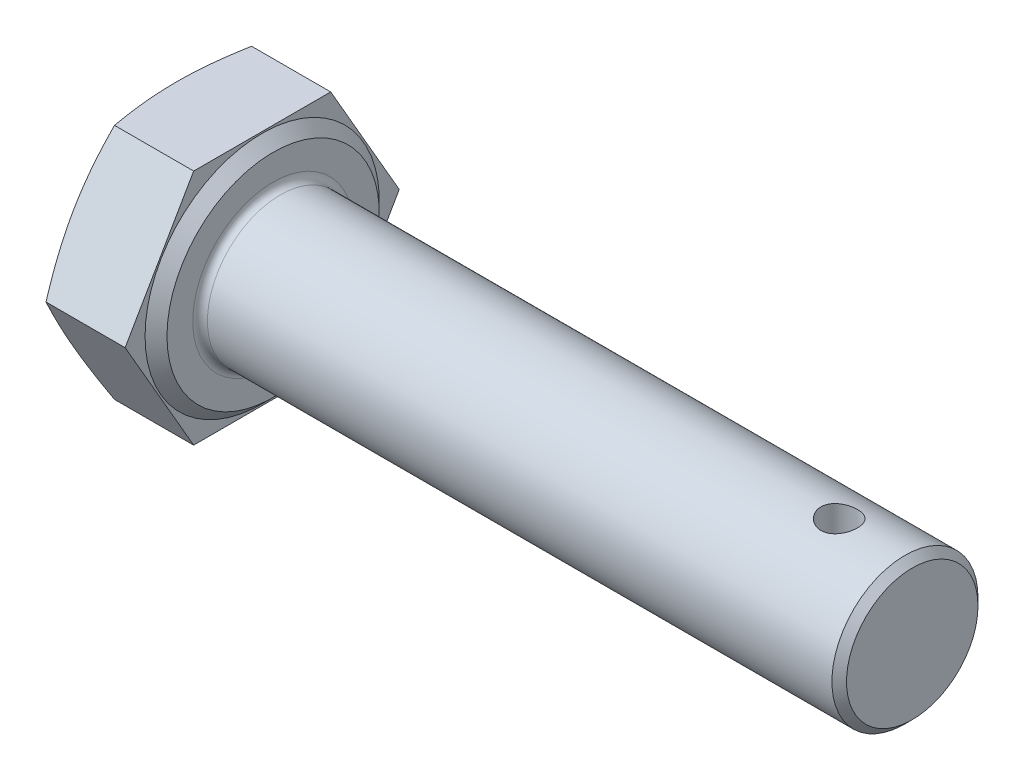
ISO-10303-21;
HEADER;
FILE_DESCRIPTION(('STEP AP214'),'2;1');
FILE_NAME('part.step','',(''),(''),'','','');
FILE_SCHEMA(('AUTOMOTIVE_DESIGN { 1 0 10303 214 1 1 1 1 }'));
ENDSEC;
DATA;
#1=APPLICATION_CONTEXT('core data for automotive mechanical design processes');
#2=APPLICATION_PROTOCOL_DEFINITION('international standard','automotive_design',2000,#1);
#3=PRODUCT_CONTEXT('',#1,'mechanical');
#4=PRODUCT('Part','Part','',(#3));
#5=PRODUCT_RELATED_PRODUCT_CATEGORY('part','',(#4));
#6=PRODUCT_DEFINITION_FORMATION('','',#4);
#7=PRODUCT_DEFINITION_CONTEXT('part definition',#1,'design');
#8=PRODUCT_DEFINITION('design','',#6,#7);
#9=PRODUCT_DEFINITION_SHAPE('','',#8);
#10=(LENGTH_UNIT() NAMED_UNIT(*) SI_UNIT(.MILLI.,.METRE.));
#11=(NAMED_UNIT(*) PLANE_ANGLE_UNIT() SI_UNIT($,.RADIAN.));
#12=(NAMED_UNIT(*) SI_UNIT($,.STERADIAN.) SOLID_ANGLE_UNIT());
#13=UNCERTAINTY_MEASURE_WITH_UNIT(LENGTH_MEASURE(1.E-05),#10,'distance_accuracy_value','');
#14=(GEOMETRIC_REPRESENTATION_CONTEXT(3) GLOBAL_UNCERTAINTY_ASSIGNED_CONTEXT((#13)) GLOBAL_UNIT_ASSIGNED_CONTEXT((#10,
#11,#12)) REPRESENTATION_CONTEXT('',''));
#15=CARTESIAN_POINT('',(0.,0.,0.));
#16=DIRECTION('',(0.,0.,1.));
#17=DIRECTION('',(1.,0.,0.));
#18=AXIS2_PLACEMENT_3D('',#15,#16,#17);
#19=CARTESIAN_POINT('',(5.3,0.,-7.50555349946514));
#20=DIRECTION('',(1.,0.,0.));
#21=DIRECTION('',(0.,0.,-1.));
#22=AXIS2_PLACEMENT_3D('',#19,#20,#21);
#23=PLANE('',#22);
#24=CARTESIAN_POINT('',(5.3,0.,0.));
#25=DIRECTION('',(1.,0.,0.));
#26=DIRECTION('',(0.,0.,-1.));
#27=AXIS2_PLACEMENT_3D('',#24,#25,#26);
#28=CIRCLE('',#27,4.4);
#29=CARTESIAN_POINT('',(5.3,0.,-4.4));
#30=VERTEX_POINT('',#29);
#31=EDGE_CURVE('E11',#30,#30,#28,.F.);
#32=ORIENTED_EDGE('',*,*,#31,.T.);
#33=EDGE_LOOP('',(#32));
#34=FACE_BOUND('',#33,.T.);
#35=CARTESIAN_POINT('',(5.3,0.,0.));
#36=DIRECTION('',(-1.,0.,0.));
#37=DIRECTION('',(0.,0.,1.));
#38=AXIS2_PLACEMENT_3D('',#35,#36,#37);
#39=CIRCLE('',#38,5.815);
#40=CARTESIAN_POINT('',(5.3,0.,5.815));
#41=VERTEX_POINT('',#40);
#42=EDGE_CURVE('E397',#41,#41,#39,.T.);
#43=ORIENTED_EDGE('',*,*,#42,.F.);
#44=EDGE_LOOP('',(#43));
#45=FACE_BOUND('',#44,.T.);
#46=ADVANCED_FACE('F37',(#34,#45),#23,.T.);
#47=CARTESIAN_POINT('',(5.3,-6.49999999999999,-3.75277674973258));
#48=DIRECTION('',(0.,0.5,0.866025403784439));
#49=DIRECTION('',(0.,-0.866025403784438,0.5));
#50=AXIS2_PLACEMENT_3D('',#47,#48,#49);
#51=PLANE('',#50);
#52=CARTESIAN_POINT('',(0.366033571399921,0.00019999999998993,-7.50566896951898));
#53=CARTESIAN_POINT('',(0.309444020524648,-0.26899576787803,-7.35024872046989));
#54=CARTESIAN_POINT('',(0.257966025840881,-0.539079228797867,-7.19431596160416));
#55=CARTESIAN_POINT('',(0.167398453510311,-1.08100226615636,-6.88143655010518));
#56=CARTESIAN_POINT('',(0.128318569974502,-1.35284304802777,-6.724489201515));
#57=CARTESIAN_POINT('',(0.0651079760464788,-1.89526390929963,-6.41132237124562));
#58=CARTESIAN_POINT('',(0.0408393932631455,-2.16583160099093,-6.25511004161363));
#59=CARTESIAN_POINT('',(0.00828840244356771,-2.70759971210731,-5.94232007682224));
#60=CARTESIAN_POINT('',(0.,-2.97879985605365,-5.78574260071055));
#61=CARTESIAN_POINT('',(0.,-3.52120014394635,-5.47258764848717));
#62=CARTESIAN_POINT('',(0.00828840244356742,-3.79240028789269,-5.31601017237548));
#63=CARTESIAN_POINT('',(0.0408393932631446,-4.33416839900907,-5.00322020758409));
#64=CARTESIAN_POINT('',(0.0651079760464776,-4.60473609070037,-4.8470078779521));
#65=CARTESIAN_POINT('',(0.1283185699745,-5.14715695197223,-4.53384104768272));
#66=CARTESIAN_POINT('',(0.16739845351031,-5.41899773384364,-4.37689369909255));
#67=CARTESIAN_POINT('',(0.25796602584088,-5.96092077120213,-4.06401428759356));
#68=CARTESIAN_POINT('',(0.309444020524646,-6.23100423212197,-3.90808152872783));
#69=CARTESIAN_POINT('',(0.366033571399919,-6.50019999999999,-3.75266127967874));
#70=B_SPLINE_CURVE_WITH_KNOTS('',3,(#52,#53,#54,#55,#56,#57,#58,#59,#60,#61,#62,#63,#64,#65,#66,
#67,#68,#69),.UNSPECIFIED.,.F.,.F.,(4,2,2,2,2,2,2,2,4),(0.,0.947946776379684,1.89663293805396,
2.83634783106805,3.77571015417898,4.71507247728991,5.654787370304,6.60347353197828,
7.55142030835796),.UNSPECIFIED.);
#71=CARTESIAN_POINT('',(0.365991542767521,0.,-7.50555349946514));
#72=VERTEX_POINT('',#71);
#73=CARTESIAN_POINT('',(0.,-3.25,-5.62916512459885));
#74=VERTEX_POINT('',#73);
#75=EDGE_CURVE('E115',#72,#74,#70,.T.);
#76=ORIENTED_EDGE('',*,*,#75,.F.);
#77=DIRECTION('',(-1.,0.,0.));
#78=VECTOR('',#77,1.);
#79=CARTESIAN_POINT('',(5.3,0.,-7.50555349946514));
#80=LINE('',#79,#78);
#81=CARTESIAN_POINT('',(4.7,0.,-7.50555349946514));
#82=VERTEX_POINT('',#81);
#83=EDGE_CURVE('E144',#82,#72,#80,.T.);
#84=ORIENTED_EDGE('',*,*,#83,.F.);
#85=DIRECTION('',(0.,0.866025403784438,-0.5));
#86=VECTOR('',#85,1.);
#87=CARTESIAN_POINT('',(4.7,-6.49999999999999,-3.75277674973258));
#88=LINE('',#87,#86);
#89=CARTESIAN_POINT('',(4.7,-6.49999999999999,-3.75277674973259));
#90=VERTEX_POINT('',#89);
#91=EDGE_CURVE('E412',#90,#82,#88,.T.);
#92=ORIENTED_EDGE('',*,*,#91,.F.);
#93=DIRECTION('',(-1.,0.,0.));
#94=VECTOR('',#93,1.);
#95=CARTESIAN_POINT('',(5.3,-6.49999999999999,-3.75277674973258));
#96=LINE('',#95,#94);
#97=CARTESIAN_POINT('',(0.365991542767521,-6.49999999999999,-3.75277674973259));
#98=VERTEX_POINT('',#97);
#99=EDGE_CURVE('E138',#90,#98,#96,.T.);
#100=ORIENTED_EDGE('',*,*,#99,.T.);
#101=EDGE_CURVE('E243',#74,#98,#70,.T.);
#102=ORIENTED_EDGE('',*,*,#101,.F.);
#103=EDGE_LOOP('',(#76,#84,#92,#100,#102));
#104=FACE_BOUND('',#103,.T.);
#105=ADVANCED_FACE('F193',(#104),#51,.F.);
#106=CARTESIAN_POINT('',(5.3,0.,-7.50555349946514));
#107=DIRECTION('',(0.,-0.500000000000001,0.866025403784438));
#108=DIRECTION('',(0.,-0.866025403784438,-0.500000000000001));
#109=AXIS2_PLACEMENT_3D('',#106,#107,#108);
#110=PLANE('',#109);
#111=CARTESIAN_POINT('',(0.366033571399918,6.5002,-3.75266127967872));
#112=CARTESIAN_POINT('',(0.309444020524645,6.23100423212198,-3.90808152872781));
#113=CARTESIAN_POINT('',(0.257966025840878,5.96092077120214,-4.06401428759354));
#114=CARTESIAN_POINT('',(0.167398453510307,5.41899773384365,-4.37689369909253));
#115=CARTESIAN_POINT('',(0.128318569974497,5.14715695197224,-4.5338410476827));
#116=CARTESIAN_POINT('',(0.0651079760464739,4.60473609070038,-4.84700787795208));
#117=CARTESIAN_POINT('',(0.0408393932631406,4.33416839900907,-5.00322020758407));
#118=CARTESIAN_POINT('',(0.00828840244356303,3.79240028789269,-5.31601017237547));
#119=CARTESIAN_POINT('',(0.,3.52120014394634,-5.47258764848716));
#120=CARTESIAN_POINT('',(0.,2.97879985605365,-5.78574260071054));
#121=CARTESIAN_POINT('',(0.00828840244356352,2.7075997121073,-5.94232007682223));
#122=CARTESIAN_POINT('',(0.0408393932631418,2.16583160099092,-6.25511004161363));
#123=CARTESIAN_POINT('',(0.0651079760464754,1.89526390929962,-6.41132237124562));
#124=CARTESIAN_POINT('',(0.128318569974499,1.35284304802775,-6.72448920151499));
#125=CARTESIAN_POINT('',(0.167398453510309,1.08100226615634,-6.88143655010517));
#126=CARTESIAN_POINT('',(0.25796602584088,0.539079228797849,-7.19431596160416));
#127=CARTESIAN_POINT('',(0.309444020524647,0.268995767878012,-7.35024872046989));
#128=CARTESIAN_POINT('',(0.366033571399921,-0.00020000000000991,-7.50566896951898));
#129=B_SPLINE_CURVE_WITH_KNOTS('',3,(#111,#112,#113,#114,#115,#116,#117,#118,#119,#120,#121,
#122,#123,#124,#125,#126,#127,#128),.UNSPECIFIED.,.F.,.F.,(4,2,2,2,2,2,2,2,4),(0.,
0.947946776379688,1.89663293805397,2.83634783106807,3.775710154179,4.71507247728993,
5.65478737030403,6.60347353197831,7.551420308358),.UNSPECIFIED.);
#130=CARTESIAN_POINT('',(0.365991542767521,6.5,-3.75277674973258));
#131=VERTEX_POINT('',#130);
#132=CARTESIAN_POINT('',(0.,3.25,-5.62916512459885));
#133=VERTEX_POINT('',#132);
#134=EDGE_CURVE('E258',#131,#133,#129,.T.);
#135=ORIENTED_EDGE('',*,*,#134,.F.);
#136=DIRECTION('',(-1.,0.,0.));
#137=VECTOR('',#136,1.);
#138=CARTESIAN_POINT('',(5.3,6.5,-3.75277674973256));
#139=LINE('',#138,#137);
#140=CARTESIAN_POINT('',(4.7,6.5,-3.75277674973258));
#141=VERTEX_POINT('',#140);
#142=EDGE_CURVE('E135',#141,#131,#139,.T.);
#143=ORIENTED_EDGE('',*,*,#142,.F.);
#144=DIRECTION('',(0.,0.866025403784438,0.500000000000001));
#145=VECTOR('',#144,1.);
#146=CARTESIAN_POINT('',(4.7,0.,-7.50555349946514));
#147=LINE('',#146,#145);
#148=EDGE_CURVE('E414',#82,#141,#147,.T.);
#149=ORIENTED_EDGE('',*,*,#148,.F.);
#150=ORIENTED_EDGE('',*,*,#83,.T.);
#151=EDGE_CURVE('E126',#133,#72,#129,.T.);
#152=ORIENTED_EDGE('',*,*,#151,.F.);
#153=EDGE_LOOP('',(#135,#143,#149,#150,#152));
#154=FACE_BOUND('',#153,.T.);
#155=ADVANCED_FACE('F199',(#154),#110,.F.);
#156=CARTESIAN_POINT('',(5.3,6.5,-3.75277674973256));
#157=DIRECTION('',(0.,-1.,0.));
#158=DIRECTION('',(0.,0.,-1.));
#159=AXIS2_PLACEMENT_3D('',#156,#157,#158);
#160=PLANE('',#159);
#161=CARTESIAN_POINT('',(1.9557136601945,6.5,-9.93603326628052));
#162=CARTESIAN_POINT('',(1.86616534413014,6.5,-9.64194976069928));
#163=CARTESIAN_POINT('',(1.77766194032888,6.5,-9.34754216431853));
#164=CARTESIAN_POINT('',(1.60332300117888,6.5,-8.75791379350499));
#165=CARTESIAN_POINT('',(1.51748767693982,6.5,-8.46269295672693));
#166=CARTESIAN_POINT('',(1.34892015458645,6.5,-7.87076780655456));
#167=CARTESIAN_POINT('',(1.26619404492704,6.5,-7.57406175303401));
#168=CARTESIAN_POINT('',(1.1048134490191,6.5,-6.9795459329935));
#169=CARTESIAN_POINT('',(1.02615888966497,6.5,-6.68173618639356));
#170=CARTESIAN_POINT('',(0.874868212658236,6.5,-6.08849459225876));
#171=CARTESIAN_POINT('',(0.802169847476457,6.5,-5.79307869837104));
#172=CARTESIAN_POINT('',(0.662962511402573,6.5,-5.20077688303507));
#173=CARTESIAN_POINT('',(0.596453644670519,6.5,-4.90389093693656));
#174=CARTESIAN_POINT('',(0.471175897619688,6.5,-4.30858258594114));
#175=CARTESIAN_POINT('',(0.412404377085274,6.5,-4.01016074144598));
#176=CARTESIAN_POINT('',(0.304390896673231,6.5,-3.41158450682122));
#177=CARTESIAN_POINT('',(0.25514861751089,6.5,-3.1114301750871));
#178=CARTESIAN_POINT('',(0.17306978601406,6.5,-2.54318752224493));
#179=CARTESIAN_POINT('',(0.139012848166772,6.5,-2.27527713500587));
#180=CARTESIAN_POINT('',(0.0813625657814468,6.5,-1.738323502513));
#181=CARTESIAN_POINT('',(0.0577689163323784,6.5,-1.46928029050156));
#182=CARTESIAN_POINT('',(0.0221814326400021,6.5,-0.930606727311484));
#183=CARTESIAN_POINT('',(0.0101793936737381,6.5,-0.660976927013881));
#184=CARTESIAN_POINT('',(-0.00161720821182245,6.5,-0.121447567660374));
#185=CARTESIAN_POINT('',(-0.00141185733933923,6.5,0.148451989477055));
#186=CARTESIAN_POINT('',(0.0112271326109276,6.5,0.689329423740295));
#187=CARTESIAN_POINT('',(0.0237227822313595,6.5,0.960305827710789));
#188=CARTESIAN_POINT('',(0.060367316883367,6.5,1.50146271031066));
#189=CARTESIAN_POINT('',(0.0845164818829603,6.5,1.7716431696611));
#190=CARTESIAN_POINT('',(0.143338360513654,6.5,2.31107475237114));
#191=CARTESIAN_POINT('',(0.178020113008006,6.5,2.58032487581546));
#192=CARTESIAN_POINT('',(0.256500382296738,6.5,3.11747812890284));
#193=CARTESIAN_POINT('',(0.300298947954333,6.5,3.38538125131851));
#194=CARTESIAN_POINT('',(0.3981077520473,6.5,3.93393829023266));
#195=CARTESIAN_POINT('',(0.452535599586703,6.5,4.21451708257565));
#196=CARTESIAN_POINT('',(0.568396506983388,6.5,4.77423382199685));
#197=CARTESIAN_POINT('',(0.6298300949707,6.5,5.05337165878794));
#198=CARTESIAN_POINT('',(0.758412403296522,6.5,5.61040543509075));
#199=CARTESIAN_POINT('',(0.82556278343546,6.5,5.88830098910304));
#200=CARTESIAN_POINT('',(0.964486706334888,6.5,6.44292134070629));
#201=CARTESIAN_POINT('',(1.03626013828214,6.5,6.71964616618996));
#202=CARTESIAN_POINT('',(1.18365887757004,6.5,7.27244360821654));
#203=CARTESIAN_POINT('',(1.25928899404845,6.5,7.54851493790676));
#204=CARTESIAN_POINT('',(1.41363071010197,6.5,8.09979648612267));
#205=CARTESIAN_POINT('',(1.4923423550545,6.5,8.3750066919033));
#206=CARTESIAN_POINT('',(1.73221572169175,6.5,9.19944068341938));
#207=CARTESIAN_POINT('',(1.8971430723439,6.5,9.74756811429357));
#208=CARTESIAN_POINT('',(2.2320227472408,6.5,10.8356486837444));
#209=CARTESIAN_POINT('',(2.40189951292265,6.5,11.3756252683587));
#210=CARTESIAN_POINT('',(2.74647925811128,6.5,12.4540616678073));
#211=CARTESIAN_POINT('',(2.92118246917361,6.50000000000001,12.9925214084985));
#212=CARTESIAN_POINT('',(3.27344644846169,6.50000000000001,14.0662400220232));
#213=CARTESIAN_POINT('',(3.45099385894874,6.50000000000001,14.6015032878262));
#214=CARTESIAN_POINT('',(3.71928531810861,6.50000000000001,15.4037138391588));
#215=CARTESIAN_POINT('',(3.80904053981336,6.50000000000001,15.670992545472));
#216=CARTESIAN_POINT('',(3.98913176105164,6.50000000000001,16.2053535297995));
#217=CARTESIAN_POINT('',(4.07946775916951,6.50000000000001,16.4724358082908));
#218=CARTESIAN_POINT('',(4.17005521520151,6.50000000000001,16.7394327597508));
#219=B_SPLINE_CURVE_WITH_KNOTS('',3,(#161,#162,#163,#164,#165,#166,#167,#168,#169,#170,#171,
#172,#173,#174,#175,#176,#177,#178,#179,#180,#181,#182,#183,#184,#185,#186,#187,#188,#189,#190,
#191,#192,#193,#194,#195,#196,#197,#198,#199,#200,#201,#202,#203,#204,#205,#206,#207,#208,#209,
#210,#211,#212,#213,#214,#215,#216,#217,#218),.UNSPECIFIED.,.F.,.F.,(4,2,2,2,2,2,2,2,2,2,2,2,2,
2,2,2,2,2,2,2,2,2,2,2,2,2,2,2,4),(0.,0.922251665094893,1.8445761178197,2.76862139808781,
3.69265008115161,4.60528596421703,5.5179372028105,6.43027620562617,7.34258463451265,
8.15260590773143,8.96260357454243,9.77202749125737,10.5814456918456,11.3949688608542,
12.2085115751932,13.0227544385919,13.8370016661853,14.694319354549,15.5517017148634,
16.4093338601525,17.2669454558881,18.1256539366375,18.9843750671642,20.7015057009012,
22.3996829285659,24.0979417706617,25.7897568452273,26.6355962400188,27.4814335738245),.UNSPECIFIED.);
#220=CARTESIAN_POINT('',(0.365991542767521,6.50000000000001,3.75277674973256));
#221=VERTEX_POINT('',#220);
#222=CARTESIAN_POINT('',(0.,6.5,0.));
#223=VERTEX_POINT('',#222);
#224=EDGE_CURVE('E52',#221,#223,#219,.F.);
#225=ORIENTED_EDGE('',*,*,#224,.F.);
#226=DIRECTION('',(-1.,0.,0.));
#227=VECTOR('',#226,1.);
#228=CARTESIAN_POINT('',(5.3,6.5,3.75277674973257));
#229=LINE('',#228,#227);
#230=CARTESIAN_POINT('',(4.7,6.50000000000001,3.75277674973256));
#231=VERTEX_POINT('',#230);
#232=EDGE_CURVE('E132',#231,#221,#229,.T.);
#233=ORIENTED_EDGE('',*,*,#232,.F.);
#234=DIRECTION('',(0.,0.,1.));
#235=VECTOR('',#234,1.);
#236=CARTESIAN_POINT('',(4.7,6.5,-3.75277674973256));
#237=LINE('',#236,#235);
#238=EDGE_CURVE('E416',#141,#231,#237,.T.);
#239=ORIENTED_EDGE('',*,*,#238,.F.);
#240=ORIENTED_EDGE('',*,*,#142,.T.);
#241=EDGE_CURVE('E259',#223,#131,#219,.F.);
#242=ORIENTED_EDGE('',*,*,#241,.F.);
#243=EDGE_LOOP('',(#225,#233,#239,#240,#242));
#244=FACE_BOUND('',#243,.T.);
#245=ADVANCED_FACE('F268',(#244),#160,.F.);
#246=CARTESIAN_POINT('',(5.3,6.5,3.75277674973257));
#247=DIRECTION('',(0.,-0.5,-0.866025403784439));
#248=DIRECTION('',(0.,0.866025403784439,-0.5));
#249=AXIS2_PLACEMENT_3D('',#246,#247,#248);
#250=PLANE('',#249);
#251=CARTESIAN_POINT('',(0.366033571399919,-0.00019999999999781,7.50566896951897));
#252=CARTESIAN_POINT('',(0.309444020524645,0.268995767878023,7.35024872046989));
#253=CARTESIAN_POINT('',(0.257966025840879,0.53907922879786,7.19431596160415));
#254=CARTESIAN_POINT('',(0.167398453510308,1.08100226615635,6.88143655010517));
#255=CARTESIAN_POINT('',(0.128318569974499,1.35284304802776,6.72448920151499));
#256=CARTESIAN_POINT('',(0.0651079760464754,1.89526390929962,6.41132237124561));
#257=CARTESIAN_POINT('',(0.040839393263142,2.16583160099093,6.25511004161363));
#258=CARTESIAN_POINT('',(0.00828840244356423,2.70759971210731,5.94232007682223));
#259=CARTESIAN_POINT('',(0.,2.97879985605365,5.78574260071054));
#260=CARTESIAN_POINT('',(0.,3.52120014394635,5.47258764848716));
#261=CARTESIAN_POINT('',(0.00828840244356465,3.7924002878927,5.31601017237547));
#262=CARTESIAN_POINT('',(0.0408393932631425,4.33416839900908,5.00322020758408));
#263=CARTESIAN_POINT('',(0.0651079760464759,4.60473609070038,4.84700787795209));
#264=CARTESIAN_POINT('',(0.128318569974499,5.14715695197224,4.53384104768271));
#265=CARTESIAN_POINT('',(0.167398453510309,5.41899773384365,4.37689369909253));
#266=CARTESIAN_POINT('',(0.25796602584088,5.96092077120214,4.06401428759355));
#267=CARTESIAN_POINT('',(0.309444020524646,6.23100423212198,3.90808152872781));
#268=CARTESIAN_POINT('',(0.36603357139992,6.5002,3.75266127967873));
#269=B_SPLINE_CURVE_WITH_KNOTS('',3,(#251,#252,#253,#254,#255,#256,#257,#258,#259,#260,#261,
#262,#263,#264,#265,#266,#267,#268),.UNSPECIFIED.,.F.,.F.,(4,2,2,2,2,2,2,2,4),(0.,
0.947946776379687,1.89663293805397,2.83634783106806,3.77571015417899,4.71507247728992,
5.65478737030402,6.6034735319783,7.55142030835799),.UNSPECIFIED.);
#270=CARTESIAN_POINT('',(0.365991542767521,0.,7.50555349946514));
#271=VERTEX_POINT('',#270);
#272=CARTESIAN_POINT('',(0.,3.25,5.62916512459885));
#273=VERTEX_POINT('',#272);
#274=EDGE_CURVE('E60',#271,#273,#269,.T.);
#275=ORIENTED_EDGE('',*,*,#274,.F.);
#276=DIRECTION('',(-1.,0.,0.));
#277=VECTOR('',#276,1.);
#278=CARTESIAN_POINT('',(5.3,0.,7.50555349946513));
#279=LINE('',#278,#277);
#280=CARTESIAN_POINT('',(4.7,0.,7.50555349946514));
#281=VERTEX_POINT('',#280);
#282=EDGE_CURVE('E123',#281,#271,#279,.T.);
#283=ORIENTED_EDGE('',*,*,#282,.F.);
#284=DIRECTION('',(0.,-0.866025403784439,0.5));
#285=VECTOR('',#284,1.);
#286=CARTESIAN_POINT('',(4.7,6.5,3.75277674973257));
#287=LINE('',#286,#285);
#288=EDGE_CURVE('E420',#231,#281,#287,.T.);
#289=ORIENTED_EDGE('',*,*,#288,.F.);
#290=ORIENTED_EDGE('',*,*,#232,.T.);
#291=EDGE_CURVE('E125',#273,#221,#269,.T.);
#292=ORIENTED_EDGE('',*,*,#291,.F.);
#293=EDGE_LOOP('',(#275,#283,#289,#290,#292));
#294=FACE_BOUND('',#293,.T.);
#295=ADVANCED_FACE('F121',(#294),#250,.F.);
#296=CARTESIAN_POINT('',(5.3,0.,7.50555349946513));
#297=DIRECTION('',(0.,0.5,-0.866025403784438));
#298=DIRECTION('',(0.,0.866025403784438,0.5));
#299=AXIS2_PLACEMENT_3D('',#296,#297,#298);
#300=PLANE('',#299);
#301=CARTESIAN_POINT('',(0.366033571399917,-6.50019999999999,3.75266127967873));
#302=CARTESIAN_POINT('',(0.309444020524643,-6.23100423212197,3.90808152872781));
#303=CARTESIAN_POINT('',(0.257966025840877,-5.96092077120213,4.06401428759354));
#304=CARTESIAN_POINT('',(0.167398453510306,-5.41899773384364,4.37689369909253));
#305=CARTESIAN_POINT('',(0.128318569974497,-5.14715695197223,4.53384104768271));
#306=CARTESIAN_POINT('',(0.0651079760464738,-4.60473609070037,4.84700787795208));
#307=CARTESIAN_POINT('',(0.0408393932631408,-4.33416839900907,5.00322020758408));
#308=CARTESIAN_POINT('',(0.00828840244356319,-3.79240028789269,5.31601017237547));
#309=CARTESIAN_POINT('',(0.,-3.52120014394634,5.47258764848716));
#310=CARTESIAN_POINT('',(0.,-2.97879985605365,5.78574260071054));
#311=CARTESIAN_POINT('',(0.00828840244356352,-2.7075997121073,5.94232007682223));
#312=CARTESIAN_POINT('',(0.0408393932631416,-2.16583160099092,6.25511004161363));
#313=CARTESIAN_POINT('',(0.0651079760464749,-1.89526390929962,6.41132237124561));
#314=CARTESIAN_POINT('',(0.128318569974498,-1.35284304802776,6.72448920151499));
#315=CARTESIAN_POINT('',(0.167398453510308,-1.08100226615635,6.88143655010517));
#316=CARTESIAN_POINT('',(0.257966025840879,-0.539079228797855,7.19431596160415));
#317=CARTESIAN_POINT('',(0.309444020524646,-0.268995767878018,7.35024872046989));
#318=CARTESIAN_POINT('',(0.366033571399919,0.000200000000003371,7.50566896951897));
#319=B_SPLINE_CURVE_WITH_KNOTS('',3,(#301,#302,#303,#304,#305,#306,#307,#308,#309,#310,#311,
#312,#313,#314,#315,#316,#317,#318),.UNSPECIFIED.,.F.,.F.,(4,2,2,2,2,2,2,2,4),(0.,
0.947946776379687,1.89663293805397,2.83634783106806,3.77571015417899,4.71507247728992,
5.65478737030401,6.6034735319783,7.55142030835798),.UNSPECIFIED.);
#320=CARTESIAN_POINT('',(0.365991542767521,-6.49999999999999,3.75277674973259));
#321=VERTEX_POINT('',#320);
#322=CARTESIAN_POINT('',(0.,-3.25,5.62916512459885));
#323=VERTEX_POINT('',#322);
#324=EDGE_CURVE('E117',#321,#323,#319,.T.);
#325=ORIENTED_EDGE('',*,*,#324,.F.);
#326=DIRECTION('',(-1.,0.,0.));
#327=VECTOR('',#326,1.);
#328=CARTESIAN_POINT('',(5.3,-6.49999999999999,3.75277674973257));
#329=LINE('',#328,#327);
#330=CARTESIAN_POINT('',(4.7,-6.49999999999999,3.75277674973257));
#331=VERTEX_POINT('',#330);
#332=EDGE_CURVE('E133',#331,#321,#329,.T.);
#333=ORIENTED_EDGE('',*,*,#332,.F.);
#334=DIRECTION('',(0.,-0.866025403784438,-0.5));
#335=VECTOR('',#334,1.);
#336=CARTESIAN_POINT('',(4.7,0.,7.50555349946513));
#337=LINE('',#336,#335);
#338=EDGE_CURVE('E131',#281,#331,#337,.T.);
#339=ORIENTED_EDGE('',*,*,#338,.F.);
#340=ORIENTED_EDGE('',*,*,#282,.T.);
#341=EDGE_CURVE('E107',#323,#271,#319,.T.);
#342=ORIENTED_EDGE('',*,*,#341,.F.);
#343=EDGE_LOOP('',(#325,#333,#339,#340,#342));
#344=FACE_BOUND('',#343,.T.);
#345=ADVANCED_FACE('F129',(#344),#300,.F.);
#346=CARTESIAN_POINT('',(5.3,-6.49999999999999,3.75277674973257));
#347=DIRECTION('',(0.,1.,0.));
#348=DIRECTION('',(0.,0.,1.));
#349=AXIS2_PLACEMENT_3D('',#346,#347,#348);
#350=PLANE('',#349);
#351=CARTESIAN_POINT('',(1.9557136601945,-6.49999999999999,-9.93603326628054));
#352=CARTESIAN_POINT('',(1.86616534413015,-6.49999999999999,-9.6419497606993));
#353=CARTESIAN_POINT('',(1.77766194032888,-6.49999999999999,-9.34754216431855));
#354=CARTESIAN_POINT('',(1.60332300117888,-6.49999999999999,-8.75791379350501));
#355=CARTESIAN_POINT('',(1.51748767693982,-6.49999999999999,-8.46269295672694));
#356=CARTESIAN_POINT('',(1.34892015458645,-6.49999999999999,-7.87076780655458));
#357=CARTESIAN_POINT('',(1.26619404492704,-6.49999999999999,-7.57406175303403));
#358=CARTESIAN_POINT('',(1.10481344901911,-6.49999999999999,-6.97954593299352));
#359=CARTESIAN_POINT('',(1.02615888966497,-6.49999999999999,-6.68173618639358));
#360=CARTESIAN_POINT('',(0.874868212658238,-6.49999999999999,-6.08849459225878));
#361=CARTESIAN_POINT('',(0.802169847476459,-6.49999999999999,-5.79307869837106));
#362=CARTESIAN_POINT('',(0.662962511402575,-6.49999999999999,-5.20077688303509));
#363=CARTESIAN_POINT('',(0.596453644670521,-6.49999999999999,-4.90389093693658));
#364=CARTESIAN_POINT('',(0.471175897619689,-6.49999999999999,-4.30858258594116));
#365=CARTESIAN_POINT('',(0.412404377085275,-6.49999999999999,-4.010160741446));
#366=CARTESIAN_POINT('',(0.304390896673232,-6.49999999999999,-3.41158450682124));
#367=CARTESIAN_POINT('',(0.25514861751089,-6.49999999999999,-3.11143017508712));
#368=CARTESIAN_POINT('',(0.173069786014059,-6.49999999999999,-2.54318752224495));
#369=CARTESIAN_POINT('',(0.139012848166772,-6.49999999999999,-2.27527713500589));
#370=CARTESIAN_POINT('',(0.0813625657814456,-6.49999999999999,-1.73832350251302));
#371=CARTESIAN_POINT('',(0.0577689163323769,-6.49999999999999,-1.46928029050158));
#372=CARTESIAN_POINT('',(0.0221814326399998,-6.49999999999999,-0.930606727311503));
#373=CARTESIAN_POINT('',(0.0101793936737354,-6.49999999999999,-0.660976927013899));
#374=CARTESIAN_POINT('',(-0.00161720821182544,-6.49999999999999,-0.121447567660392));
#375=CARTESIAN_POINT('',(-0.00141185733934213,-6.49999999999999,0.148451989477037));
#376=CARTESIAN_POINT('',(0.0112271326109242,-6.49999999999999,0.689329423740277));
#377=CARTESIAN_POINT('',(0.0237227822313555,-6.49999999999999,0.960305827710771));
#378=CARTESIAN_POINT('',(0.0603673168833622,-6.49999999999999,1.50146271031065));
#379=CARTESIAN_POINT('',(0.0845164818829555,-6.49999999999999,1.77164316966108));
#380=CARTESIAN_POINT('',(0.143338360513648,-6.49999999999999,2.31107475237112));
#381=CARTESIAN_POINT('',(0.178020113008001,-6.49999999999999,2.58032487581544));
#382=CARTESIAN_POINT('',(0.256500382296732,-6.49999999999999,3.11747812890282));
#383=CARTESIAN_POINT('',(0.300298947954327,-6.49999999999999,3.38538125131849));
#384=CARTESIAN_POINT('',(0.398107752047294,-6.49999999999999,3.93393829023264));
#385=CARTESIAN_POINT('',(0.452535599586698,-6.49999999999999,4.21451708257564));
#386=CARTESIAN_POINT('',(0.568396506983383,-6.49999999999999,4.77423382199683));
#387=CARTESIAN_POINT('',(0.629830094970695,-6.49999999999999,5.05337165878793));
#388=CARTESIAN_POINT('',(0.758412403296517,-6.49999999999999,5.61040543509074));
#389=CARTESIAN_POINT('',(0.825562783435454,-6.49999999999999,5.88830098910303));
#390=CARTESIAN_POINT('',(0.964486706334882,-6.49999999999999,6.44292134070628));
#391=CARTESIAN_POINT('',(1.03626013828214,-6.49999999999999,6.71964616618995));
#392=CARTESIAN_POINT('',(1.18365887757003,-6.49999999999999,7.27244360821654));
#393=CARTESIAN_POINT('',(1.25928899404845,-6.49999999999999,7.54851493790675));
#394=CARTESIAN_POINT('',(1.41363071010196,-6.49999999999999,8.09979648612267));
#395=CARTESIAN_POINT('',(1.49234235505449,-6.49999999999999,8.3750066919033));
#396=CARTESIAN_POINT('',(1.73221572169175,-6.49999999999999,9.19944068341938));
#397=CARTESIAN_POINT('',(1.8971430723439,-6.5,9.74756811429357));
#398=CARTESIAN_POINT('',(2.2320227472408,-6.5,10.8356486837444));
#399=CARTESIAN_POINT('',(2.40189951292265,-6.5,11.3756252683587));
#400=CARTESIAN_POINT('',(2.74647925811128,-6.5,12.4540616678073));
#401=CARTESIAN_POINT('',(2.92118246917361,-6.5,12.9925214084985));
#402=CARTESIAN_POINT('',(3.27344644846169,-6.5,14.0662400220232));
#403=CARTESIAN_POINT('',(3.45099385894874,-6.5,14.6015032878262));
#404=CARTESIAN_POINT('',(3.71928531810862,-6.5,15.4037138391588));
#405=CARTESIAN_POINT('',(3.80904053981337,-6.5,15.670992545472));
#406=CARTESIAN_POINT('',(3.98913176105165,-6.5,16.2053535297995));
#407=CARTESIAN_POINT('',(4.07946775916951,-6.5,16.4724358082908));
#408=CARTESIAN_POINT('',(4.17005521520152,-6.5,16.7394327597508));
#409=B_SPLINE_CURVE_WITH_KNOTS('',3,(#351,#352,#353,#354,#355,#356,#357,#358,#359,#360,#361,
#362,#363,#364,#365,#366,#367,#368,#369,#370,#371,#372,#373,#374,#375,#376,#377,#378,#379,#380,
#381,#382,#383,#384,#385,#386,#387,#388,#389,#390,#391,#392,#393,#394,#395,#396,#397,#398,#399,
#400,#401,#402,#403,#404,#405,#406,#407,#408),.UNSPECIFIED.,.F.,.F.,(4,2,2,2,2,2,2,2,2,2,2,2,2,
2,2,2,2,2,2,2,2,2,2,2,2,2,2,2,4),(0.,0.922251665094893,1.8445761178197,2.76862139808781,
3.69265008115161,4.60528596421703,5.5179372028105,6.43027620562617,7.34258463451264,
8.15260590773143,8.96260357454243,9.77202749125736,10.5814456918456,11.3949688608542,
12.2085115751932,13.0227544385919,13.8370016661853,14.694319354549,15.5517017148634,
16.4093338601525,17.2669454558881,18.1256539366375,18.9843750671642,20.7015057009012,
22.3996829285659,24.0979417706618,25.7897568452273,26.6355962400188,27.4814335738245),.UNSPECIFIED.);
#410=CARTESIAN_POINT('',(0.,-6.49999999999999,0.));
#411=VERTEX_POINT('',#410);
#412=EDGE_CURVE('E225',#98,#411,#409,.T.);
#413=ORIENTED_EDGE('',*,*,#412,.F.);
#414=ORIENTED_EDGE('',*,*,#99,.F.);
#415=DIRECTION('',(0.,0.,-1.));
#416=VECTOR('',#415,1.);
#417=CARTESIAN_POINT('',(4.7,-6.49999999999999,3.75277674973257));
#418=LINE('',#417,#416);
#419=EDGE_CURVE('E147',#331,#90,#418,.T.);
#420=ORIENTED_EDGE('',*,*,#419,.F.);
#421=ORIENTED_EDGE('',*,*,#332,.T.);
#422=EDGE_CURVE('E219',#411,#321,#409,.T.);
#423=ORIENTED_EDGE('',*,*,#422,.F.);
#424=EDGE_LOOP('',(#413,#414,#420,#421,#423));
#425=FACE_BOUND('',#424,.T.);
#426=ADVANCED_FACE('F211',(#425),#350,.F.);
#427=CARTESIAN_POINT('',(4.7,0.,-6.41500000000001));
#428=DIRECTION('',(1.,0.,0.));
#429=DIRECTION('',(0.,0.,-1.));
#430=AXIS2_PLACEMENT_3D('',#427,#428,#429);
#431=PLANE('',#430);
#432=CARTESIAN_POINT('',(4.7,0.,0.));
#433=DIRECTION('',(-1.,0.,0.));
#434=DIRECTION('',(0.,0.,1.));
#435=AXIS2_PLACEMENT_3D('',#432,#433,#434);
#436=CIRCLE('',#435,6.41500000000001);
#437=CARTESIAN_POINT('',(4.7,0.,6.41500000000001));
#438=VERTEX_POINT('',#437);
#439=EDGE_CURVE('E423',#438,#438,#436,.T.);
#440=ORIENTED_EDGE('',*,*,#439,.T.);
#441=EDGE_LOOP('',(#440));
#442=FACE_BOUND('',#441,.T.);
#443=ORIENTED_EDGE('',*,*,#91,.T.);
#444=ORIENTED_EDGE('',*,*,#148,.T.);
#445=ORIENTED_EDGE('',*,*,#238,.T.);
#446=ORIENTED_EDGE('',*,*,#288,.T.);
#447=ORIENTED_EDGE('',*,*,#338,.T.);
#448=ORIENTED_EDGE('',*,*,#419,.T.);
#449=EDGE_LOOP('',(#443,#444,#445,#446,#447,#448));
#450=FACE_BOUND('',#449,.T.);
#451=ADVANCED_FACE('F205',(#442,#450),#431,.T.);
#452=CARTESIAN_POINT('',(4.7,0.,0.));
#453=DIRECTION('',(-1.,0.,0.));
#454=DIRECTION('',(0.,0.,1.));
#455=AXIS2_PLACEMENT_3D('',#452,#453,#454);
#456=CONICAL_SURFACE('',#455,6.41500000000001,0.785398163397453);
#457=ORIENTED_EDGE('',*,*,#42,.T.);
#458=EDGE_LOOP('',(#457));
#459=FACE_BOUND('',#458,.T.);
#460=ORIENTED_EDGE('',*,*,#439,.F.);
#461=EDGE_LOOP('',(#460));
#462=FACE_BOUND('',#461,.T.);
#463=ADVANCED_FACE('F236',(#459,#462),#456,.T.);
#464=CARTESIAN_POINT('',(0.,0.,0.));
#465=DIRECTION('',(1.,0.,0.));
#466=DIRECTION('',(0.,0.,-1.));
#467=AXIS2_PLACEMENT_3D('',#464,#465,#466);
#468=CONICAL_SURFACE('',#467,6.5,1.22173047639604);
#469=ORIENTED_EDGE('',*,*,#151,.T.);
#470=ORIENTED_EDGE('',*,*,#75,.T.);
#471=CARTESIAN_POINT('',(0.,0.,0.));
#472=DIRECTION('',(1.,0.,0.));
#473=DIRECTION('',(0.,0.,-1.));
#474=AXIS2_PLACEMENT_3D('',#471,#472,#473);
#475=CIRCLE('',#474,6.5);
#476=EDGE_CURVE('E149',#74,#133,#475,.T.);
#477=ORIENTED_EDGE('',*,*,#476,.T.);
#478=EDGE_LOOP('',(#469,#470,#477));
#479=FACE_BOUND('',#478,.T.);
#480=ADVANCED_FACE('F298',(#479),#468,.T.);
#481=ORIENTED_EDGE('',*,*,#101,.T.);
#482=ORIENTED_EDGE('',*,*,#412,.T.);
#483=EDGE_CURVE('E152',#411,#74,#475,.T.);
#484=ORIENTED_EDGE('',*,*,#483,.T.);
#485=EDGE_LOOP('',(#481,#482,#484));
#486=FACE_BOUND('',#485,.T.);
#487=ADVANCED_FACE('F305',(#486),#468,.T.);
#488=ORIENTED_EDGE('',*,*,#324,.T.);
#489=EDGE_CURVE('E410',#323,#411,#475,.T.);
#490=ORIENTED_EDGE('',*,*,#489,.T.);
#491=ORIENTED_EDGE('',*,*,#422,.T.);
#492=EDGE_LOOP('',(#488,#490,#491));
#493=FACE_BOUND('',#492,.T.);
#494=ADVANCED_FACE('F235',(#493),#468,.T.);
#495=ORIENTED_EDGE('',*,*,#274,.T.);
#496=EDGE_CURVE('E110',#273,#323,#475,.T.);
#497=ORIENTED_EDGE('',*,*,#496,.T.);
#498=ORIENTED_EDGE('',*,*,#341,.T.);
#499=EDGE_LOOP('',(#495,#497,#498));
#500=FACE_BOUND('',#499,.T.);
#501=ADVANCED_FACE('F108',(#500),#468,.T.);
#502=ORIENTED_EDGE('',*,*,#224,.T.);
#503=CARTESIAN_POINT('',(0.,0.,0.));
#504=DIRECTION('',(-1.,0.,0.));
#505=DIRECTION('',(0.,0.,1.));
#506=AXIS2_PLACEMENT_3D('',#503,#504,#505);
#507=CIRCLE('',#506,6.5);
#508=EDGE_CURVE('E226',#273,#223,#507,.T.);
#509=ORIENTED_EDGE('',*,*,#508,.F.);
#510=ORIENTED_EDGE('',*,*,#291,.T.);
#511=EDGE_LOOP('',(#502,#509,#510));
#512=FACE_BOUND('',#511,.T.);
#513=ADVANCED_FACE('F232',(#512),#468,.T.);
#514=ORIENTED_EDGE('',*,*,#241,.T.);
#515=ORIENTED_EDGE('',*,*,#134,.T.);
#516=EDGE_CURVE('E153',#133,#223,#475,.T.);
#517=ORIENTED_EDGE('',*,*,#516,.T.);
#518=EDGE_LOOP('',(#514,#515,#517));
#519=FACE_BOUND('',#518,.T.);
#520=ADVANCED_FACE('F209',(#519),#468,.T.);
#521=CARTESIAN_POINT('',(0.,0.,-7.50555349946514));
#522=DIRECTION('',(1.,0.,0.));
#523=DIRECTION('',(0.,0.,-1.));
#524=AXIS2_PLACEMENT_3D('',#521,#522,#523);
#525=PLANE('',#524);
#526=ORIENTED_EDGE('',*,*,#516,.F.);
#527=ORIENTED_EDGE('',*,*,#476,.F.);
#528=ORIENTED_EDGE('',*,*,#483,.F.);
#529=ORIENTED_EDGE('',*,*,#489,.F.);
#530=ORIENTED_EDGE('',*,*,#496,.F.);
#531=ORIENTED_EDGE('',*,*,#508,.T.);
#532=EDGE_LOOP('',(#526,#527,#528,#529,#530,#531));
#533=FACE_BOUND('',#532,.T.);
#534=ADVANCED_FACE('F190',(#533),#525,.F.);
#535=CARTESIAN_POINT('',(40.3,0.,0.));
#536=DIRECTION('',(-1.,0.,0.));
#537=DIRECTION('',(0.,0.,1.));
#538=AXIS2_PLACEMENT_3D('',#535,#536,#537);
#539=CYLINDRICAL_SURFACE('',#538,4.);
#540=CARTESIAN_POINT('',(5.7,0.,0.));
#541=DIRECTION('',(1.,0.,0.));
#542=DIRECTION('',(0.,0.,-1.));
#543=AXIS2_PLACEMENT_3D('',#540,#541,#542);
#544=CIRCLE('',#543,4.);
#545=CARTESIAN_POINT('',(5.7,0.,-4.));
#546=VERTEX_POINT('',#545);
#547=EDGE_CURVE('E45',#546,#546,#544,.T.);
#548=ORIENTED_EDGE('',*,*,#547,.T.);
#549=EDGE_LOOP('',(#548));
#550=FACE_BOUND('',#549,.T.);
#551=CARTESIAN_POINT('',(36.3,-3.87298334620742,0.999999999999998));
#552=CARTESIAN_POINT('',(36.3552203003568,-3.87298440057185,0.999998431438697));
#553=CARTESIAN_POINT('',(36.4104579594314,-3.87417722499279,0.995410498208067));
#554=CARTESIAN_POINT('',(36.5193470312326,-3.87880744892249,0.977209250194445));
#555=CARTESIAN_POINT('',(36.57299750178,-3.88224615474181,0.963590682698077));
#556=CARTESIAN_POINT('',(36.6771214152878,-3.89095489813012,0.927796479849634));
#557=CARTESIAN_POINT('',(36.7275988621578,-3.8962225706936,0.905631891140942));
#558=CARTESIAN_POINT('',(36.8241243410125,-3.90799276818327,0.853408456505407));
#559=CARTESIAN_POINT('',(36.8701721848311,-3.91449534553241,0.823349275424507));
#560=CARTESIAN_POINT('',(36.9575446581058,-3.92816286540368,0.755483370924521));
#561=CARTESIAN_POINT('',(36.9987574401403,-3.93533839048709,0.71753475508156));
#562=CARTESIAN_POINT('',(37.0743045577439,-3.94945150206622,0.635272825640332));
#563=CARTESIAN_POINT('',(37.1086382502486,-3.95638906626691,0.590958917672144));
#564=CARTESIAN_POINT('',(37.1699101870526,-3.96936166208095,0.49645808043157));
#565=CARTESIAN_POINT('',(37.1967385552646,-3.975382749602,0.446197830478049));
#566=CARTESIAN_POINT('',(37.2415238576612,-3.9857232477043,0.341705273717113));
#567=CARTESIAN_POINT('',(37.2594821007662,-3.99004290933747,0.287473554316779));
#568=CARTESIAN_POINT('',(37.2856591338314,-3.99641903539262,0.177743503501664));
#569=CARTESIAN_POINT('',(37.2940678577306,-3.99851957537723,0.12229308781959));
#570=CARTESIAN_POINT('',(37.3015033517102,-4.00037437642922,0.0107315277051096));
#571=CARTESIAN_POINT('',(37.3005315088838,-4.00012898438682,-0.0453795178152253));
#572=CARTESIAN_POINT('',(37.2893700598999,-3.99735237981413,-0.155352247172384));
#573=CARTESIAN_POINT('',(37.2793854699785,-3.99487200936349,-0.209236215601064));
#574=CARTESIAN_POINT('',(37.2508114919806,-3.98796334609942,-0.314538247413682));
#575=CARTESIAN_POINT('',(37.232221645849,-3.98353494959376,-0.365956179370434));
#576=CARTESIAN_POINT('',(37.1867989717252,-3.97315003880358,-0.465406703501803));
#577=CARTESIAN_POINT('',(37.1598931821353,-3.96718007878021,-0.5134045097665));
#578=CARTESIAN_POINT('',(37.0986577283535,-3.9543596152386,-0.604275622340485));
#579=CARTESIAN_POINT('',(37.0643267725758,-3.94750895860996,-0.647148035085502));
#580=CARTESIAN_POINT('',(36.988116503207,-3.93345485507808,-0.727774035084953));
#581=CARTESIAN_POINT('',(36.9460580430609,-3.92624687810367,-0.765357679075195));
#582=CARTESIAN_POINT('',(36.8561600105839,-3.91246017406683,-0.832976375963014));
#583=CARTESIAN_POINT('',(36.8083201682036,-3.90588147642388,-0.863011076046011));
#584=CARTESIAN_POINT('',(36.7078839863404,-3.89408198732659,-0.914788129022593));
#585=CARTESIAN_POINT('',(36.6552657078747,-3.88886793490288,-0.936489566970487));
#586=CARTESIAN_POINT('',(36.5469658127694,-3.88047456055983,-0.970685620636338));
#587=CARTESIAN_POINT('',(36.4912848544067,-3.87729480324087,-0.983182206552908));
#588=CARTESIAN_POINT('',(36.3800161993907,-3.87342142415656,-0.998331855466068));
#589=CARTESIAN_POINT('',(36.3244648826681,-3.87266435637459,-1.00123618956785));
#590=CARTESIAN_POINT('',(36.2136712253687,-3.87354937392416,-0.997806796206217));
#591=CARTESIAN_POINT('',(36.1584288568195,-3.87519123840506,-0.991473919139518));
#592=CARTESIAN_POINT('',(36.0507542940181,-3.88062832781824,-0.969970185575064));
#593=CARTESIAN_POINT('',(35.9982909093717,-3.8843878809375,-0.954945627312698));
#594=CARTESIAN_POINT('',(35.8966274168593,-3.89360287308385,-0.916647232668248));
#595=CARTESIAN_POINT('',(35.8474276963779,-3.89905851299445,-0.893372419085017));
#596=CARTESIAN_POINT('',(35.7526234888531,-3.91118454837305,-0.838708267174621));
#597=CARTESIAN_POINT('',(35.7071084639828,-3.91787667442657,-0.80716870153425));
#598=CARTESIAN_POINT('',(35.6219246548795,-3.93166833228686,-0.737060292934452));
#599=CARTESIAN_POINT('',(35.58225683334,-3.93876793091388,-0.698490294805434));
#600=CARTESIAN_POINT('',(35.5088755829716,-3.95278961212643,-0.614262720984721));
#601=CARTESIAN_POINT('',(35.4753359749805,-3.95970280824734,-0.56845195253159));
#602=CARTESIAN_POINT('',(35.4164256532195,-3.97238886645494,-0.471702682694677));
#603=CARTESIAN_POINT('',(35.3910545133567,-3.97816178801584,-0.420764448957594));
#604=CARTESIAN_POINT('',(35.3494215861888,-3.98788046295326,-0.315558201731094));
#605=CARTESIAN_POINT('',(35.3330942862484,-3.99183932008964,-0.261317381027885));
#606=CARTESIAN_POINT('',(35.3098158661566,-3.99754117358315,-0.150749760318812));
#607=CARTESIAN_POINT('',(35.3028629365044,-3.99928459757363,-0.0944233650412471));
#608=CARTESIAN_POINT('',(35.2986324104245,-4.00034169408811,0.0170835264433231));
#609=CARTESIAN_POINT('',(35.3010982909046,-3.99971978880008,0.0722538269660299));
#610=CARTESIAN_POINT('',(35.3150478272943,-3.99625896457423,0.181367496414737));
#611=CARTESIAN_POINT('',(35.3265312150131,-3.99342011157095,0.235310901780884));
#612=CARTESIAN_POINT('',(35.3580522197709,-3.98585432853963,0.340171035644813));
#613=CARTESIAN_POINT('',(35.3780434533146,-3.98113764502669,0.391102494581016));
#614=CARTESIAN_POINT('',(35.4259705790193,-3.97031288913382,0.488917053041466));
#615=CARTESIAN_POINT('',(35.4539074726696,-3.96420464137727,0.535799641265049));
#616=CARTESIAN_POINT('',(35.5177152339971,-3.95107249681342,0.6254019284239));
#617=CARTESIAN_POINT('',(35.5537601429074,-3.94403016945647,0.667994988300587));
#618=CARTESIAN_POINT('',(35.6324228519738,-3.92990649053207,0.74661502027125));
#619=CARTESIAN_POINT('',(35.6750423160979,-3.92282512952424,0.782640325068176));
#620=CARTESIAN_POINT('',(35.7666014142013,-3.90927475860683,0.847762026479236));
#621=CARTESIAN_POINT('',(35.8156441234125,-3.90281963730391,0.876716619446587));
#622=CARTESIAN_POINT('',(35.9180554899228,-3.8914395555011,0.925926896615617));
#623=CARTESIAN_POINT('',(35.9714209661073,-3.88651348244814,0.946188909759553));
#624=CARTESIAN_POINT('',(36.0705770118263,-3.87951908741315,0.974422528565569));
#625=CARTESIAN_POINT('',(36.1158931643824,-3.87708663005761,0.983993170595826));
#626=CARTESIAN_POINT('',(36.2074688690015,-3.87381838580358,0.996782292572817));
#627=CARTESIAN_POINT('',(36.2537283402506,-3.87298246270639,1.00000131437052));
#628=CARTESIAN_POINT('',(36.3,-3.87298334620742,0.999999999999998));
#629=B_SPLINE_CURVE_WITH_KNOTS('',3,(#551,#552,#553,#554,#555,#556,#557,#558,#559,#560,#561,
#562,#563,#564,#565,#566,#567,#568,#569,#570,#571,#572,#573,#574,#575,#576,#577,#578,#579,#580,
#581,#582,#583,#584,#585,#586,#587,#588,#589,#590,#591,#592,#593,#594,#595,#596,#597,#598,#599,
#600,#601,#602,#603,#604,#605,#606,#607,#608,#609,#610,#611,#612,#613,#614,#615,#616,#617,#618,
#619,#620,#621,#622,#623,#624,#625,#626,#627,#628),.UNSPECIFIED.,.T.,.F.,(4,2,2,2,2,2,2,2,2,2,2,
2,2,2,2,2,2,2,2,2,2,2,2,2,2,2,2,2,2,2,2,2,2,2,2,2,2,2,4),(0.,0.165490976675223,
0.331078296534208,0.496452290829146,0.661833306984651,0.830495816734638,0.9991740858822,
1.17020598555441,1.34121263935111,1.50875500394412,1.67627259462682,1.84007305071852,
2.00388222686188,2.16917149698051,2.33448954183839,2.50428186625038,2.67408212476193,
2.84470572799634,3.01529280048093,3.1813742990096,3.34744050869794,3.51078961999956,
3.67415808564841,3.84073138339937,4.00733207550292,4.17810132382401,4.34886166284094,
4.51836829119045,4.68784219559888,4.85273378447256,5.01762046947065,5.18161950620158,
5.34563922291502,5.51358838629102,5.68158012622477,5.85270590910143,6.02370688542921,
6.16239130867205,6.30106390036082),.UNSPECIFIED.);
#630=CARTESIAN_POINT('',(36.3,-3.87298334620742,0.999999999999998));
#631=VERTEX_POINT('',#630);
#632=EDGE_CURVE('E168',#631,#631,#629,.T.);
#633=ORIENTED_EDGE('',*,*,#632,.T.);
#634=EDGE_LOOP('',(#633));
#635=FACE_BOUND('',#634,.T.);
#636=CARTESIAN_POINT('',(36.3,3.87298334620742,0.999999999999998));
#637=CARTESIAN_POINT('',(36.2447796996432,3.87298440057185,0.999998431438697));
#638=CARTESIAN_POINT('',(36.1895420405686,3.87417722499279,0.995410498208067));
#639=CARTESIAN_POINT('',(36.0806529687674,3.87880744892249,0.977209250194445));
#640=CARTESIAN_POINT('',(36.02700249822,3.88224615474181,0.963590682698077));
#641=CARTESIAN_POINT('',(35.9228785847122,3.89095489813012,0.927796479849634));
#642=CARTESIAN_POINT('',(35.8724011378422,3.8962225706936,0.905631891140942));
#643=CARTESIAN_POINT('',(35.7758756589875,3.90799276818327,0.853408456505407));
#644=CARTESIAN_POINT('',(35.7298278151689,3.91449534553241,0.823349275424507));
#645=CARTESIAN_POINT('',(35.6424553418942,3.92816286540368,0.755483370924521));
#646=CARTESIAN_POINT('',(35.6012425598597,3.93533839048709,0.71753475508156));
#647=CARTESIAN_POINT('',(35.5256954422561,3.94945150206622,0.635272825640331));
#648=CARTESIAN_POINT('',(35.4913617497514,3.95638906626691,0.590958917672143));
#649=CARTESIAN_POINT('',(35.4300898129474,3.96936166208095,0.496458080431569));
#650=CARTESIAN_POINT('',(35.4032614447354,3.975382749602,0.446197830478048));
#651=CARTESIAN_POINT('',(35.3584761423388,3.9857232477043,0.341705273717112));
#652=CARTESIAN_POINT('',(35.3405178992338,3.99004290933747,0.287473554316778));
#653=CARTESIAN_POINT('',(35.3143408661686,3.99641903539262,0.177743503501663));
#654=CARTESIAN_POINT('',(35.3059321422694,3.99851957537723,0.12229308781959));
#655=CARTESIAN_POINT('',(35.2984966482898,4.00037437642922,0.0107315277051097));
#656=CARTESIAN_POINT('',(35.2994684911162,4.00012898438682,-0.0453795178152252));
#657=CARTESIAN_POINT('',(35.3106299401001,3.99735237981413,-0.155352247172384));
#658=CARTESIAN_POINT('',(35.3206145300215,3.99487200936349,-0.209236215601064));
#659=CARTESIAN_POINT('',(35.3491885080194,3.98796334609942,-0.314538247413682));
#660=CARTESIAN_POINT('',(35.367778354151,3.98353494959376,-0.365956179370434));
#661=CARTESIAN_POINT('',(35.4132010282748,3.97315003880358,-0.465406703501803));
#662=CARTESIAN_POINT('',(35.4401068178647,3.96718007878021,-0.5134045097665));
#663=CARTESIAN_POINT('',(35.5013422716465,3.9543596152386,-0.604275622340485));
#664=CARTESIAN_POINT('',(35.5356732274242,3.94750895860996,-0.647148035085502));
#665=CARTESIAN_POINT('',(35.6118834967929,3.93345485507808,-0.727774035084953));
#666=CARTESIAN_POINT('',(35.6539419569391,3.92624687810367,-0.765357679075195));
#667=CARTESIAN_POINT('',(35.7438399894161,3.91246017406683,-0.832976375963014));
#668=CARTESIAN_POINT('',(35.7916798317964,3.90588147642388,-0.863011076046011));
#669=CARTESIAN_POINT('',(35.8921160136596,3.89408198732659,-0.914788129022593));
#670=CARTESIAN_POINT('',(35.9447342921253,3.88886793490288,-0.936489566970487));
#671=CARTESIAN_POINT('',(36.0530341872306,3.88047456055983,-0.970685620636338));
#672=CARTESIAN_POINT('',(36.1087151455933,3.87729480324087,-0.983182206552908));
#673=CARTESIAN_POINT('',(36.2199838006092,3.87342142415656,-0.998331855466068));
#674=CARTESIAN_POINT('',(36.2755351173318,3.87266435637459,-1.00123618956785));
#675=CARTESIAN_POINT('',(36.3863287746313,3.87354937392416,-0.997806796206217));
#676=CARTESIAN_POINT('',(36.4415711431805,3.87519123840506,-0.991473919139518));
#677=CARTESIAN_POINT('',(36.5492457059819,3.88062832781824,-0.969970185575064));
#678=CARTESIAN_POINT('',(36.6017090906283,3.8843878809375,-0.954945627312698));
#679=CARTESIAN_POINT('',(36.7033725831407,3.89360287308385,-0.916647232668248));
#680=CARTESIAN_POINT('',(36.7525723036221,3.89905851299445,-0.893372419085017));
#681=CARTESIAN_POINT('',(36.8473765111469,3.91118454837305,-0.838708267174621));
#682=CARTESIAN_POINT('',(36.8928915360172,3.91787667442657,-0.80716870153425));
#683=CARTESIAN_POINT('',(36.9780753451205,3.93166833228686,-0.737060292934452));
#684=CARTESIAN_POINT('',(37.01774316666,3.93876793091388,-0.698490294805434));
#685=CARTESIAN_POINT('',(37.0911244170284,3.95278961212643,-0.614262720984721));
#686=CARTESIAN_POINT('',(37.1246640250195,3.95970280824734,-0.56845195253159));
#687=CARTESIAN_POINT('',(37.1835743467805,3.97238886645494,-0.471702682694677));
#688=CARTESIAN_POINT('',(37.2089454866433,3.97816178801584,-0.420764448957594));
#689=CARTESIAN_POINT('',(37.2505784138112,3.98788046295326,-0.315558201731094));
#690=CARTESIAN_POINT('',(37.2669057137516,3.99183932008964,-0.261317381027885));
#691=CARTESIAN_POINT('',(37.2901841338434,3.99754117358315,-0.150749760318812));
#692=CARTESIAN_POINT('',(37.2971370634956,3.99928459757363,-0.0944233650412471));
#693=CARTESIAN_POINT('',(37.3013675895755,4.00034169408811,0.0170835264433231));
#694=CARTESIAN_POINT('',(37.2989017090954,3.99971978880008,0.0722538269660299));
#695=CARTESIAN_POINT('',(37.2849521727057,3.99625896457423,0.181367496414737));
#696=CARTESIAN_POINT('',(37.2734687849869,3.99342011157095,0.235310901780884));
#697=CARTESIAN_POINT('',(37.2419477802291,3.98585432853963,0.340171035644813));
#698=CARTESIAN_POINT('',(37.2219565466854,3.98113764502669,0.391102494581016));
#699=CARTESIAN_POINT('',(37.1740294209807,3.97031288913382,0.488917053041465));
#700=CARTESIAN_POINT('',(37.1460925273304,3.96420464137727,0.535799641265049));
#701=CARTESIAN_POINT('',(37.0822847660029,3.95107249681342,0.625401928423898));
#702=CARTESIAN_POINT('',(37.0462398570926,3.94403016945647,0.667994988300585));
#703=CARTESIAN_POINT('',(36.9675771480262,3.92990649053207,0.746615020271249));
#704=CARTESIAN_POINT('',(36.9249576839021,3.92282512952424,0.782640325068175));
#705=CARTESIAN_POINT('',(36.8333985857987,3.90927475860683,0.847762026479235));
#706=CARTESIAN_POINT('',(36.7843558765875,3.90281963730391,0.876716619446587));
#707=CARTESIAN_POINT('',(36.6819445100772,3.8914395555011,0.925926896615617));
#708=CARTESIAN_POINT('',(36.6285790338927,3.88651348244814,0.946188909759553));
#709=CARTESIAN_POINT('',(36.5294229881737,3.87951908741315,0.974422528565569));
#710=CARTESIAN_POINT('',(36.4841068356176,3.87708663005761,0.983993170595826));
#711=CARTESIAN_POINT('',(36.3925311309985,3.87381838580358,0.996782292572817));
#712=CARTESIAN_POINT('',(36.3462716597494,3.87298246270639,1.00000131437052));
#713=CARTESIAN_POINT('',(36.3,3.87298334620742,0.999999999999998));
#714=B_SPLINE_CURVE_WITH_KNOTS('',3,(#636,#637,#638,#639,#640,#641,#642,#643,#644,#645,#646,
#647,#648,#649,#650,#651,#652,#653,#654,#655,#656,#657,#658,#659,#660,#661,#662,#663,#664,#665,
#666,#667,#668,#669,#670,#671,#672,#673,#674,#675,#676,#677,#678,#679,#680,#681,#682,#683,#684,
#685,#686,#687,#688,#689,#690,#691,#692,#693,#694,#695,#696,#697,#698,#699,#700,#701,#702,#703,
#704,#705,#706,#707,#708,#709,#710,#711,#712,#713),.UNSPECIFIED.,.T.,.F.,(4,2,2,2,2,2,2,2,2,2,2,
2,2,2,2,2,2,2,2,2,2,2,2,2,2,2,2,2,2,2,2,2,2,2,2,2,2,2,4),(0.,0.165490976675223,
0.331078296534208,0.496452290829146,0.661833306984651,0.830495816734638,0.9991740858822,
1.17020598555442,1.34121263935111,1.50875500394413,1.67627259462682,1.84007305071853,
2.00388222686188,2.16917149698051,2.33448954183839,2.50428186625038,2.67408212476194,
2.84470572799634,3.01529280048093,3.1813742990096,3.34744050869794,3.51078961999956,
3.67415808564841,3.84073138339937,4.00733207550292,4.17810132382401,4.34886166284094,
4.51836829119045,4.68784219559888,4.85273378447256,5.01762046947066,5.18161950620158,
5.34563922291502,5.51358838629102,5.68158012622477,5.85270590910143,6.02370688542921,
6.16239130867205,6.30106390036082),.UNSPECIFIED.);
#715=CARTESIAN_POINT('',(36.3,3.87298334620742,0.999999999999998));
#716=VERTEX_POINT('',#715);
#717=EDGE_CURVE('E160',#716,#716,#714,.T.);
#718=ORIENTED_EDGE('',*,*,#717,.T.);
#719=EDGE_LOOP('',(#718));
#720=FACE_BOUND('',#719,.T.);
#721=CARTESIAN_POINT('',(39.9,0.,0.));
#722=DIRECTION('',(1.,0.,0.));
#723=DIRECTION('',(0.,0.,-1.));
#724=AXIS2_PLACEMENT_3D('',#721,#722,#723);
#725=CIRCLE('',#724,4.);
#726=CARTESIAN_POINT('',(39.9,0.,-4.));
#727=VERTEX_POINT('',#726);
#728=EDGE_CURVE('E157',#727,#727,#725,.F.);
#729=ORIENTED_EDGE('',*,*,#728,.T.);
#730=EDGE_LOOP('',(#729));
#731=FACE_BOUND('',#730,.T.);
#732=ADVANCED_FACE('F172',(#550,#635,#720,#731),#539,.T.);
#733=CARTESIAN_POINT('',(40.3,0.,0.));
#734=DIRECTION('',(1.,0.,0.));
#735=DIRECTION('',(0.,0.,-1.));
#736=AXIS2_PLACEMENT_3D('',#733,#734,#735);
#737=PLANE('',#736);
#738=CARTESIAN_POINT('',(40.3,0.,0.));
#739=DIRECTION('',(1.,0.,0.));
#740=DIRECTION('',(0.,0.,-1.));
#741=AXIS2_PLACEMENT_3D('',#738,#739,#740);
#742=CIRCLE('',#741,3.60000000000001);
#743=CARTESIAN_POINT('',(40.3,0.,-3.60000000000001));
#744=VERTEX_POINT('',#743);
#745=EDGE_CURVE('E154',#744,#744,#742,.T.);
#746=ORIENTED_EDGE('',*,*,#745,.T.);
#747=EDGE_LOOP('',(#746));
#748=FACE_BOUND('',#747,.T.);
#749=ADVANCED_FACE('F181',(#748),#737,.T.);
#750=CARTESIAN_POINT('',(40.3,0.,0.));
#751=DIRECTION('',(-1.,0.,0.));
#752=DIRECTION('',(0.,0.,1.));
#753=AXIS2_PLACEMENT_3D('',#750,#751,#752);
#754=CONICAL_SURFACE('',#753,3.60000000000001,0.785398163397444);
#755=ORIENTED_EDGE('',*,*,#728,.F.);
#756=EDGE_LOOP('',(#755));
#757=FACE_BOUND('',#756,.T.);
#758=ORIENTED_EDGE('',*,*,#745,.F.);
#759=EDGE_LOOP('',(#758));
#760=FACE_BOUND('',#759,.T.);
#761=ADVANCED_FACE('F179',(#757,#760),#754,.T.);
#762=CARTESIAN_POINT('',(36.3,-6.5,0.));
#763=DIRECTION('',(0.,1.,0.));
#764=DIRECTION('',(0.,0.,1.));
#765=AXIS2_PLACEMENT_3D('',#762,#763,#764);
#766=CYLINDRICAL_SURFACE('',#765,0.999999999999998);
#767=ORIENTED_EDGE('',*,*,#717,.F.);
#768=EDGE_LOOP('',(#767));
#769=FACE_BOUND('',#768,.T.);
#770=ORIENTED_EDGE('',*,*,#632,.F.);
#771=EDGE_LOOP('',(#770));
#772=FACE_BOUND('',#771,.T.);
#773=ADVANCED_FACE('F176',(#769,#772),#766,.F.);
#774=CARTESIAN_POINT('',(5.7,0.,0.));
#775=DIRECTION('',(1.,0.,0.));
#776=DIRECTION('',(0.,0.,-1.));
#777=AXIS2_PLACEMENT_3D('',#774,#775,#776);
#778=TOROIDAL_SURFACE('',#777,4.4,0.4);
#779=ORIENTED_EDGE('',*,*,#31,.F.);
#780=EDGE_LOOP('',(#779));
#781=FACE_BOUND('',#780,.T.);
#782=ORIENTED_EDGE('',*,*,#547,.F.);
#783=EDGE_LOOP('',(#782));
#784=FACE_BOUND('',#783,.T.);
#785=ADVANCED_FACE('F39',(#781,#784),#778,.F.);
#786=CLOSED_SHELL('',(#46,#105,#155,#245,#295,#345,#426,#451,#463,#480,#487,#494,#501,#513,#520,
#534,#732,#749,#761,#773,#785));
#787=MANIFOLD_SOLID_BREP('B2',#786);
#788=ADVANCED_BREP_SHAPE_REPRESENTATION('',(#18,#787),#14);
#789=SHAPE_DEFINITION_REPRESENTATION(#9,#788);
ENDSEC;
END-ISO-10303-21;
